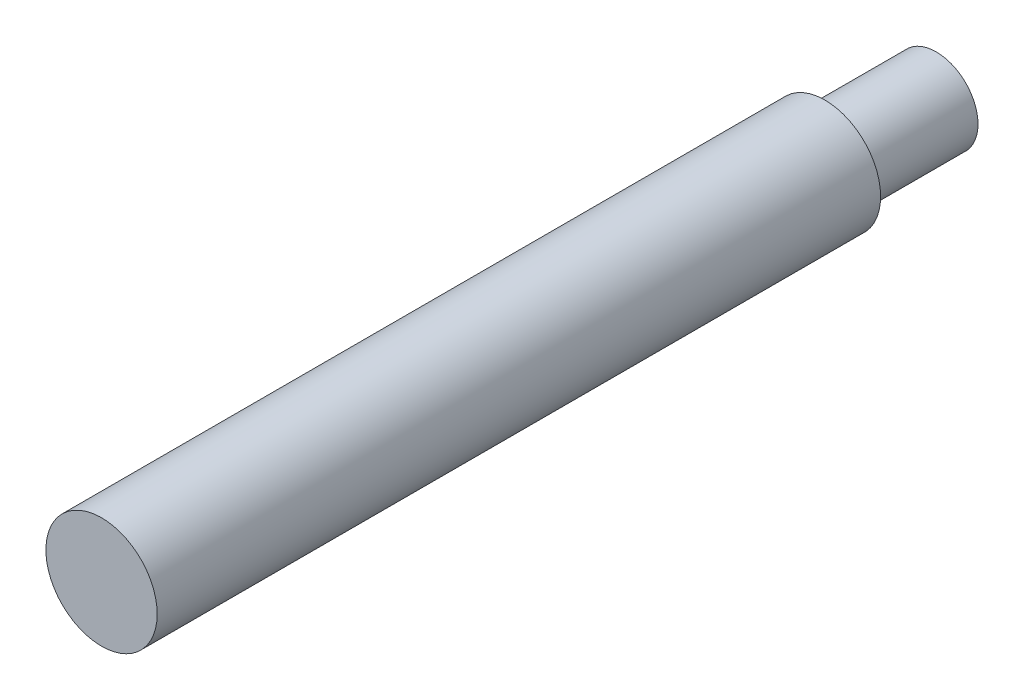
ISO-10303-21;
HEADER;
FILE_DESCRIPTION(('STEP AP214'),'2;1');
FILE_NAME('part.step','',(''),(''),'','','');
FILE_SCHEMA(('AUTOMOTIVE_DESIGN { 1 0 10303 214 1 1 1 1 }'));
ENDSEC;
DATA;
#1=APPLICATION_CONTEXT('core data for automotive mechanical design processes');
#2=APPLICATION_PROTOCOL_DEFINITION('international standard','automotive_design',2000,#1);
#3=PRODUCT_CONTEXT('',#1,'mechanical');
#4=PRODUCT('Part','Part','',(#3));
#5=PRODUCT_RELATED_PRODUCT_CATEGORY('part','',(#4));
#6=PRODUCT_DEFINITION_FORMATION('','',#4);
#7=PRODUCT_DEFINITION_CONTEXT('part definition',#1,'design');
#8=PRODUCT_DEFINITION('design','',#6,#7);
#9=PRODUCT_DEFINITION_SHAPE('','',#8);
#10=(LENGTH_UNIT() NAMED_UNIT(*) SI_UNIT(.MILLI.,.METRE.));
#11=(NAMED_UNIT(*) PLANE_ANGLE_UNIT() SI_UNIT($,.RADIAN.));
#12=(NAMED_UNIT(*) SI_UNIT($,.STERADIAN.) SOLID_ANGLE_UNIT());
#13=UNCERTAINTY_MEASURE_WITH_UNIT(LENGTH_MEASURE(1.E-05),#10,'distance_accuracy_value','');
#14=(GEOMETRIC_REPRESENTATION_CONTEXT(3) GLOBAL_UNCERTAINTY_ASSIGNED_CONTEXT((#13)) GLOBAL_UNIT_ASSIGNED_CONTEXT((#10,
#11,#12)) REPRESENTATION_CONTEXT('',''));
#15=CARTESIAN_POINT('',(0.,0.,0.));
#16=DIRECTION('',(0.,0.,1.));
#17=DIRECTION('',(1.,0.,0.));
#18=AXIS2_PLACEMENT_3D('',#15,#16,#17);
#19=CARTESIAN_POINT('',(0.,0.,0.));
#20=DIRECTION('',(0.,0.,1.));
#21=DIRECTION('',(1.,0.,0.));
#22=AXIS2_PLACEMENT_3D('',#19,#20,#21);
#23=PLANE('',#22);
#24=CARTESIAN_POINT('',(0.,0.,0.));
#25=DIRECTION('',(0.,0.,1.));
#26=DIRECTION('',(1.,0.,0.));
#27=AXIS2_PLACEMENT_3D('',#24,#25,#26);
#28=CIRCLE('',#27,12.7);
#29=CARTESIAN_POINT('',(12.7,0.,0.));
#30=VERTEX_POINT('',#29);
#31=EDGE_CURVE('E39',#30,#30,#28,.T.);
#32=ORIENTED_EDGE('',*,*,#31,.F.);
#33=EDGE_LOOP('',(#32));
#34=FACE_BOUND('',#33,.T.);
#35=CARTESIAN_POINT('',(0.,0.,0.));
#36=DIRECTION('',(0.,0.,1.));
#37=DIRECTION('',(1.,0.,0.));
#38=AXIS2_PLACEMENT_3D('',#35,#36,#37);
#39=CIRCLE('',#38,9.525);
#40=CARTESIAN_POINT('',(9.525,0.,0.));
#41=VERTEX_POINT('',#40);
#42=EDGE_CURVE('E10',#41,#41,#39,.F.);
#43=ORIENTED_EDGE('',*,*,#42,.F.);
#44=EDGE_LOOP('',(#43));
#45=FACE_BOUND('',#44,.T.);
#46=ADVANCED_FACE('F28',(#34,#45),#23,.F.);
#47=CARTESIAN_POINT('',(0.,0.,165.1));
#48=DIRECTION('',(0.,0.,-1.));
#49=DIRECTION('',(-1.,0.,0.));
#50=AXIS2_PLACEMENT_3D('',#47,#48,#49);
#51=CYLINDRICAL_SURFACE('',#50,12.7);
#52=CARTESIAN_POINT('',(0.,0.,165.1));
#53=DIRECTION('',(0.,0.,1.));
#54=DIRECTION('',(1.,0.,0.));
#55=AXIS2_PLACEMENT_3D('',#52,#53,#54);
#56=CIRCLE('',#55,12.7);
#57=CARTESIAN_POINT('',(12.7,0.,165.1));
#58=VERTEX_POINT('',#57);
#59=EDGE_CURVE('E35',#58,#58,#56,.T.);
#60=ORIENTED_EDGE('',*,*,#59,.F.);
#61=EDGE_LOOP('',(#60));
#62=FACE_BOUND('',#61,.T.);
#63=ORIENTED_EDGE('',*,*,#31,.T.);
#64=EDGE_LOOP('',(#63));
#65=FACE_BOUND('',#64,.T.);
#66=ADVANCED_FACE('F30',(#62,#65),#51,.T.);
#67=CARTESIAN_POINT('',(0.,0.,165.1));
#68=DIRECTION('',(0.,0.,1.));
#69=DIRECTION('',(1.,0.,0.));
#70=AXIS2_PLACEMENT_3D('',#67,#68,#69);
#71=PLANE('',#70);
#72=ORIENTED_EDGE('',*,*,#59,.T.);
#73=EDGE_LOOP('',(#72));
#74=FACE_BOUND('',#73,.T.);
#75=ADVANCED_FACE('F53',(#74),#71,.T.);
#76=CARTESIAN_POINT('',(0.,0.,-25.4));
#77=DIRECTION('',(0.,0.,1.));
#78=DIRECTION('',(1.,0.,0.));
#79=AXIS2_PLACEMENT_3D('',#76,#77,#78);
#80=CYLINDRICAL_SURFACE('',#79,9.525);
#81=CARTESIAN_POINT('',(0.,0.,-25.4));
#82=DIRECTION('',(0.,0.,-1.));
#83=DIRECTION('',(-1.,0.,0.));
#84=AXIS2_PLACEMENT_3D('',#81,#82,#83);
#85=CIRCLE('',#84,9.525);
#86=CARTESIAN_POINT('',(-9.525,0.,-25.4));
#87=VERTEX_POINT('',#86);
#88=EDGE_CURVE('E43',#87,#87,#85,.T.);
#89=ORIENTED_EDGE('',*,*,#88,.F.);
#90=EDGE_LOOP('',(#89));
#91=FACE_BOUND('',#90,.T.);
#92=ORIENTED_EDGE('',*,*,#42,.T.);
#93=EDGE_LOOP('',(#92));
#94=FACE_BOUND('',#93,.T.);
#95=ADVANCED_FACE('F51',(#91,#94),#80,.T.);
#96=CARTESIAN_POINT('',(0.,0.,-25.4));
#97=DIRECTION('',(0.,0.,-1.));
#98=DIRECTION('',(-1.,0.,0.));
#99=AXIS2_PLACEMENT_3D('',#96,#97,#98);
#100=PLANE('',#99);
#101=ORIENTED_EDGE('',*,*,#88,.T.);
#102=EDGE_LOOP('',(#101));
#103=FACE_BOUND('',#102,.T.);
#104=ADVANCED_FACE('F49',(#103),#100,.T.);
#105=CLOSED_SHELL('',(#46,#66,#75,#95,#104));
#106=MANIFOLD_SOLID_BREP('B2',#105);
#107=ADVANCED_BREP_SHAPE_REPRESENTATION('',(#18,#106),#14);
#108=SHAPE_DEFINITION_REPRESENTATION(#9,#107);
ENDSEC;
END-ISO-10303-21;
